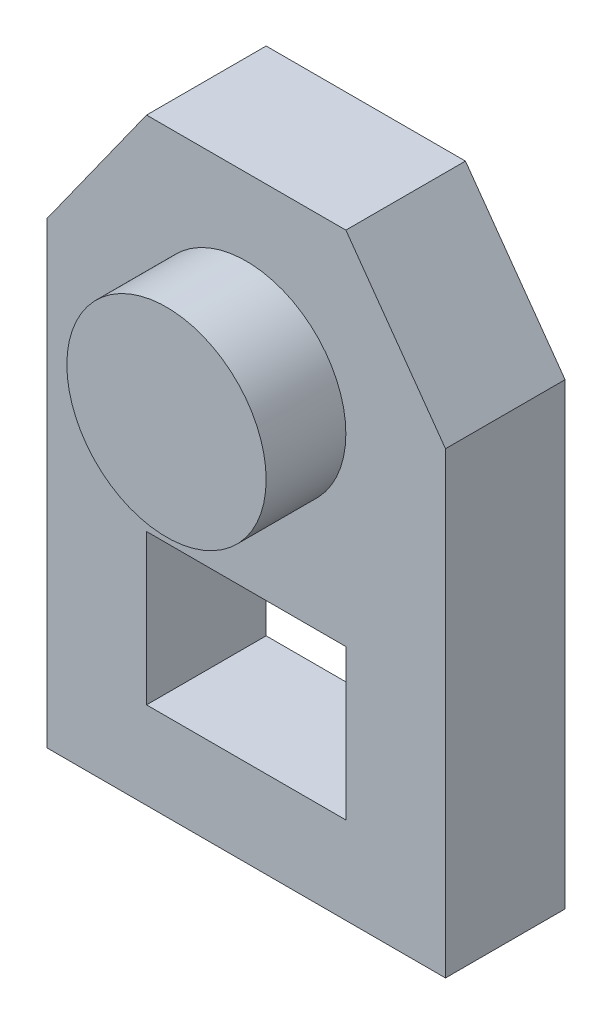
ISO-10303-21;
HEADER;
FILE_DESCRIPTION(('STEP AP214'),'2;1');
FILE_NAME('part.step','',(''),(''),'','','');
FILE_SCHEMA(('AUTOMOTIVE_DESIGN { 1 0 10303 214 1 1 1 1 }'));
ENDSEC;
DATA;
#1=APPLICATION_CONTEXT('core data for automotive mechanical design processes');
#2=APPLICATION_PROTOCOL_DEFINITION('international standard','automotive_design',2000,#1);
#3=PRODUCT_CONTEXT('',#1,'mechanical');
#4=PRODUCT('Part','Part','',(#3));
#5=PRODUCT_RELATED_PRODUCT_CATEGORY('part','',(#4));
#6=PRODUCT_DEFINITION_FORMATION('','',#4);
#7=PRODUCT_DEFINITION_CONTEXT('part definition',#1,'design');
#8=PRODUCT_DEFINITION('design','',#6,#7);
#9=PRODUCT_DEFINITION_SHAPE('','',#8);
#10=(LENGTH_UNIT() NAMED_UNIT(*) SI_UNIT(.MILLI.,.METRE.));
#11=(NAMED_UNIT(*) PLANE_ANGLE_UNIT() SI_UNIT($,.RADIAN.));
#12=(NAMED_UNIT(*) SI_UNIT($,.STERADIAN.) SOLID_ANGLE_UNIT());
#13=UNCERTAINTY_MEASURE_WITH_UNIT(LENGTH_MEASURE(1.E-05),#10,'distance_accuracy_value','');
#14=(GEOMETRIC_REPRESENTATION_CONTEXT(3) GLOBAL_UNCERTAINTY_ASSIGNED_CONTEXT((#13)) GLOBAL_UNIT_ASSIGNED_CONTEXT((#10,
#11,#12)) REPRESENTATION_CONTEXT('',''));
#15=CARTESIAN_POINT('',(0.,0.,0.));
#16=DIRECTION('',(0.,0.,1.));
#17=DIRECTION('',(1.,0.,0.));
#18=AXIS2_PLACEMENT_3D('',#15,#16,#17);
#19=CARTESIAN_POINT('',(0.,74.,12.));
#20=DIRECTION('',(0.,0.,1.));
#21=DIRECTION('',(1.,0.,0.));
#22=AXIS2_PLACEMENT_3D('',#19,#20,#21);
#23=PLANE('',#22);
#24=DIRECTION('',(0.,1.,0.));
#25=VECTOR('',#24,1.);
#26=CARTESIAN_POINT('',(10.,23.8052365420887,12.));
#27=LINE('',#26,#25);
#28=CARTESIAN_POINT('',(10.,8.73732717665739,12.));
#29=VERTEX_POINT('',#28);
#30=CARTESIAN_POINT('',(10.,23.8052365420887,12.));
#31=VERTEX_POINT('',#30);
#32=EDGE_CURVE('E46',#29,#31,#27,.T.);
#33=ORIENTED_EDGE('',*,*,#32,.F.);
#34=DIRECTION('',(1.,0.,0.));
#35=VECTOR('',#34,1.);
#36=CARTESIAN_POINT('',(10.,8.73732717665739,12.));
#37=LINE('',#36,#35);
#38=CARTESIAN_POINT('',(-10.,8.73732717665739,12.));
#39=VERTEX_POINT('',#38);
#40=EDGE_CURVE('E126',#39,#29,#37,.T.);
#41=ORIENTED_EDGE('',*,*,#40,.F.);
#42=DIRECTION('',(0.,-1.,0.));
#43=VECTOR('',#42,1.);
#44=CARTESIAN_POINT('',(-10.,23.8052365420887,12.));
#45=LINE('',#44,#43);
#46=CARTESIAN_POINT('',(-10.,23.8052365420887,12.));
#47=VERTEX_POINT('',#46);
#48=EDGE_CURVE('E111',#47,#39,#45,.T.);
#49=ORIENTED_EDGE('',*,*,#48,.F.);
#50=DIRECTION('',(-1.,0.,0.));
#51=VECTOR('',#50,1.);
#52=CARTESIAN_POINT('',(-10.,23.8052365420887,12.));
#53=LINE('',#52,#51);
#54=EDGE_CURVE('E120',#31,#47,#53,.T.);
#55=ORIENTED_EDGE('',*,*,#54,.F.);
#56=EDGE_LOOP('',(#33,#41,#49,#55));
#57=FACE_BOUND('',#56,.T.);
#58=DIRECTION('',(-0.581238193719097,-0.813733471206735,0.));
#59=VECTOR('',#58,1.);
#60=CARTESIAN_POINT('',(-10.,60.,12.));
#61=LINE('',#60,#59);
#62=CARTESIAN_POINT('',(-10.,60.,12.));
#63=VERTEX_POINT('',#62);
#64=CARTESIAN_POINT('',(-20.,46.,12.));
#65=VERTEX_POINT('',#64);
#66=EDGE_CURVE('E142',#63,#65,#61,.T.);
#67=ORIENTED_EDGE('',*,*,#66,.T.);
#68=DIRECTION('',(0.,-1.,0.));
#69=VECTOR('',#68,1.);
#70=CARTESIAN_POINT('',(-20.,46.,12.));
#71=LINE('',#70,#69);
#72=CARTESIAN_POINT('',(-20.,0.,12.));
#73=VERTEX_POINT('',#72);
#74=EDGE_CURVE('E145',#65,#73,#71,.T.);
#75=ORIENTED_EDGE('',*,*,#74,.T.);
#76=DIRECTION('',(1.,0.,0.));
#77=VECTOR('',#76,1.);
#78=CARTESIAN_POINT('',(-20.,0.,12.));
#79=LINE('',#78,#77);
#80=CARTESIAN_POINT('',(20.,0.,12.));
#81=VERTEX_POINT('',#80);
#82=EDGE_CURVE('E148',#73,#81,#79,.T.);
#83=ORIENTED_EDGE('',*,*,#82,.T.);
#84=DIRECTION('',(0.,1.,0.));
#85=VECTOR('',#84,1.);
#86=CARTESIAN_POINT('',(20.,46.,12.));
#87=LINE('',#86,#85);
#88=CARTESIAN_POINT('',(20.,46.,12.));
#89=VERTEX_POINT('',#88);
#90=EDGE_CURVE('E150',#81,#89,#87,.T.);
#91=ORIENTED_EDGE('',*,*,#90,.T.);
#92=DIRECTION('',(-0.581238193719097,0.813733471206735,0.));
#93=VECTOR('',#92,1.);
#94=CARTESIAN_POINT('',(10.,60.,12.));
#95=LINE('',#94,#93);
#96=CARTESIAN_POINT('',(10.,60.,12.));
#97=VERTEX_POINT('',#96);
#98=EDGE_CURVE('E152',#89,#97,#95,.T.);
#99=ORIENTED_EDGE('',*,*,#98,.T.);
#100=DIRECTION('',(-1.,0.,0.));
#101=VECTOR('',#100,1.);
#102=CARTESIAN_POINT('',(10.,60.,12.));
#103=LINE('',#102,#101);
#104=EDGE_CURVE('E154',#97,#63,#103,.T.);
#105=ORIENTED_EDGE('',*,*,#104,.T.);
#106=EDGE_LOOP('',(#67,#75,#83,#91,#99,#105));
#107=FACE_BOUND('',#106,.T.);
#108=CARTESIAN_POINT('',(0.,42.3114607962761,12.));
#109=DIRECTION('',(0.,0.,1.));
#110=DIRECTION('',(1.,0.,0.));
#111=AXIS2_PLACEMENT_3D('',#108,#109,#110);
#112=CIRCLE('',#111,10.);
#113=CARTESIAN_POINT('',(10.,42.3114607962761,12.));
#114=VERTEX_POINT('',#113);
#115=EDGE_CURVE('E133',#114,#114,#112,.T.);
#116=ORIENTED_EDGE('',*,*,#115,.F.);
#117=EDGE_LOOP('',(#116));
#118=FACE_BOUND('',#117,.T.);
#119=ADVANCED_FACE('F31',(#57,#107,#118),#23,.T.);
#120=CARTESIAN_POINT('',(-10.,60.,12.));
#121=DIRECTION('',(0.813733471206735,-0.581238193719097,0.));
#122=DIRECTION('',(0.581238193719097,0.813733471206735,0.));
#123=AXIS2_PLACEMENT_3D('',#120,#121,#122);
#124=PLANE('',#123);
#125=DIRECTION('',(-0.581238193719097,-0.813733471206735,0.));
#126=VECTOR('',#125,1.);
#127=CARTESIAN_POINT('',(-10.,60.,0.));
#128=LINE('',#127,#126);
#129=CARTESIAN_POINT('',(-10.,60.,0.));
#130=VERTEX_POINT('',#129);
#131=CARTESIAN_POINT('',(-20.,46.,0.));
#132=VERTEX_POINT('',#131);
#133=EDGE_CURVE('E139',#130,#132,#128,.T.);
#134=ORIENTED_EDGE('',*,*,#133,.T.);
#135=DIRECTION('',(0.,0.,-1.));
#136=VECTOR('',#135,1.);
#137=CARTESIAN_POINT('',(-20.,46.,12.));
#138=LINE('',#137,#136);
#139=EDGE_CURVE('E182',#65,#132,#138,.T.);
#140=ORIENTED_EDGE('',*,*,#139,.F.);
#141=ORIENTED_EDGE('',*,*,#66,.F.);
#142=DIRECTION('',(0.,0.,-1.));
#143=VECTOR('',#142,1.);
#144=CARTESIAN_POINT('',(-10.,60.,12.));
#145=LINE('',#144,#143);
#146=EDGE_CURVE('E156',#63,#130,#145,.T.);
#147=ORIENTED_EDGE('',*,*,#146,.T.);
#148=EDGE_LOOP('',(#134,#140,#141,#147));
#149=FACE_BOUND('',#148,.T.);
#150=ADVANCED_FACE('F33',(#149),#124,.F.);
#151=CARTESIAN_POINT('',(-20.,46.,12.));
#152=DIRECTION('',(1.,0.,0.));
#153=DIRECTION('',(0.,1.,0.));
#154=AXIS2_PLACEMENT_3D('',#151,#152,#153);
#155=PLANE('',#154);
#156=DIRECTION('',(0.,-1.,0.));
#157=VECTOR('',#156,1.);
#158=CARTESIAN_POINT('',(-20.,46.,0.));
#159=LINE('',#158,#157);
#160=CARTESIAN_POINT('',(-20.,0.,0.));
#161=VERTEX_POINT('',#160);
#162=EDGE_CURVE('E159',#132,#161,#159,.T.);
#163=ORIENTED_EDGE('',*,*,#162,.T.);
#164=DIRECTION('',(0.,0.,-1.));
#165=VECTOR('',#164,1.);
#166=CARTESIAN_POINT('',(-20.,0.,12.));
#167=LINE('',#166,#165);
#168=EDGE_CURVE('E179',#73,#161,#167,.T.);
#169=ORIENTED_EDGE('',*,*,#168,.F.);
#170=ORIENTED_EDGE('',*,*,#74,.F.);
#171=ORIENTED_EDGE('',*,*,#139,.T.);
#172=EDGE_LOOP('',(#163,#169,#170,#171));
#173=FACE_BOUND('',#172,.T.);
#174=ADVANCED_FACE('F212',(#173),#155,.F.);
#175=CARTESIAN_POINT('',(-20.,0.,12.));
#176=DIRECTION('',(0.,1.,0.));
#177=DIRECTION('',(0.,0.,1.));
#178=AXIS2_PLACEMENT_3D('',#175,#176,#177);
#179=PLANE('',#178);
#180=DIRECTION('',(1.,0.,0.));
#181=VECTOR('',#180,1.);
#182=CARTESIAN_POINT('',(-20.,0.,0.));
#183=LINE('',#182,#181);
#184=CARTESIAN_POINT('',(20.,0.,0.));
#185=VERTEX_POINT('',#184);
#186=EDGE_CURVE('E161',#161,#185,#183,.T.);
#187=ORIENTED_EDGE('',*,*,#186,.T.);
#188=DIRECTION('',(0.,0.,-1.));
#189=VECTOR('',#188,1.);
#190=CARTESIAN_POINT('',(20.,0.,12.));
#191=LINE('',#190,#189);
#192=EDGE_CURVE('E176',#81,#185,#191,.T.);
#193=ORIENTED_EDGE('',*,*,#192,.F.);
#194=ORIENTED_EDGE('',*,*,#82,.F.);
#195=ORIENTED_EDGE('',*,*,#168,.T.);
#196=EDGE_LOOP('',(#187,#193,#194,#195));
#197=FACE_BOUND('',#196,.T.);
#198=ADVANCED_FACE('F229',(#197),#179,.F.);
#199=CARTESIAN_POINT('',(20.,46.,12.));
#200=DIRECTION('',(-1.,0.,0.));
#201=DIRECTION('',(0.,-1.,0.));
#202=AXIS2_PLACEMENT_3D('',#199,#200,#201);
#203=PLANE('',#202);
#204=DIRECTION('',(0.,1.,0.));
#205=VECTOR('',#204,1.);
#206=CARTESIAN_POINT('',(20.,46.,0.));
#207=LINE('',#206,#205);
#208=CARTESIAN_POINT('',(20.,46.,0.));
#209=VERTEX_POINT('',#208);
#210=EDGE_CURVE('E163',#185,#209,#207,.T.);
#211=ORIENTED_EDGE('',*,*,#210,.T.);
#212=DIRECTION('',(0.,0.,-1.));
#213=VECTOR('',#212,1.);
#214=CARTESIAN_POINT('',(20.,46.,12.));
#215=LINE('',#214,#213);
#216=EDGE_CURVE('E173',#89,#209,#215,.T.);
#217=ORIENTED_EDGE('',*,*,#216,.F.);
#218=ORIENTED_EDGE('',*,*,#90,.F.);
#219=ORIENTED_EDGE('',*,*,#192,.T.);
#220=EDGE_LOOP('',(#211,#217,#218,#219));
#221=FACE_BOUND('',#220,.T.);
#222=ADVANCED_FACE('F225',(#221),#203,.F.);
#223=CARTESIAN_POINT('',(10.,60.,12.));
#224=DIRECTION('',(-0.813733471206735,-0.581238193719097,0.));
#225=DIRECTION('',(0.581238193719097,-0.813733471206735,0.));
#226=AXIS2_PLACEMENT_3D('',#223,#224,#225);
#227=PLANE('',#226);
#228=DIRECTION('',(-0.581238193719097,0.813733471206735,0.));
#229=VECTOR('',#228,1.);
#230=CARTESIAN_POINT('',(10.,60.,0.));
#231=LINE('',#230,#229);
#232=CARTESIAN_POINT('',(10.,60.,0.));
#233=VERTEX_POINT('',#232);
#234=EDGE_CURVE('E165',#209,#233,#231,.T.);
#235=ORIENTED_EDGE('',*,*,#234,.T.);
#236=DIRECTION('',(0.,0.,-1.));
#237=VECTOR('',#236,1.);
#238=CARTESIAN_POINT('',(10.,60.,12.));
#239=LINE('',#238,#237);
#240=EDGE_CURVE('E170',#97,#233,#239,.T.);
#241=ORIENTED_EDGE('',*,*,#240,.F.);
#242=ORIENTED_EDGE('',*,*,#98,.F.);
#243=ORIENTED_EDGE('',*,*,#216,.T.);
#244=EDGE_LOOP('',(#235,#241,#242,#243));
#245=FACE_BOUND('',#244,.T.);
#246=ADVANCED_FACE('F221',(#245),#227,.F.);
#247=CARTESIAN_POINT('',(10.,60.,12.));
#248=DIRECTION('',(0.,-1.,0.));
#249=DIRECTION('',(0.,0.,-1.));
#250=AXIS2_PLACEMENT_3D('',#247,#248,#249);
#251=PLANE('',#250);
#252=DIRECTION('',(-1.,0.,0.));
#253=VECTOR('',#252,1.);
#254=CARTESIAN_POINT('',(10.,60.,0.));
#255=LINE('',#254,#253);
#256=EDGE_CURVE('E146',#233,#130,#255,.T.);
#257=ORIENTED_EDGE('',*,*,#256,.T.);
#258=ORIENTED_EDGE('',*,*,#146,.F.);
#259=ORIENTED_EDGE('',*,*,#104,.F.);
#260=ORIENTED_EDGE('',*,*,#240,.T.);
#261=EDGE_LOOP('',(#257,#258,#259,#260));
#262=FACE_BOUND('',#261,.T.);
#263=ADVANCED_FACE('F218',(#262),#251,.F.);
#264=CARTESIAN_POINT('',(0.,74.,0.));
#265=DIRECTION('',(0.,0.,1.));
#266=DIRECTION('',(1.,0.,0.));
#267=AXIS2_PLACEMENT_3D('',#264,#265,#266);
#268=PLANE('',#267);
#269=DIRECTION('',(1.,0.,0.));
#270=VECTOR('',#269,1.);
#271=CARTESIAN_POINT('',(0.,8.73732717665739,0.));
#272=LINE('',#271,#270);
#273=CARTESIAN_POINT('',(-10.,8.73732717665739,0.));
#274=VERTEX_POINT('',#273);
#275=CARTESIAN_POINT('',(10.,8.73732717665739,0.));
#276=VERTEX_POINT('',#275);
#277=EDGE_CURVE('E39',#274,#276,#272,.T.);
#278=ORIENTED_EDGE('',*,*,#277,.T.);
#279=DIRECTION('',(0.,1.,0.));
#280=VECTOR('',#279,1.);
#281=CARTESIAN_POINT('',(10.,74.,0.));
#282=LINE('',#281,#280);
#283=CARTESIAN_POINT('',(10.,23.8052365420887,0.));
#284=VERTEX_POINT('',#283);
#285=EDGE_CURVE('E11',#276,#284,#282,.T.);
#286=ORIENTED_EDGE('',*,*,#285,.T.);
#287=DIRECTION('',(-1.,0.,0.));
#288=VECTOR('',#287,1.);
#289=CARTESIAN_POINT('',(0.,23.8052365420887,0.));
#290=LINE('',#289,#288);
#291=CARTESIAN_POINT('',(-10.,23.8052365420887,0.));
#292=VERTEX_POINT('',#291);
#293=EDGE_CURVE('E185',#284,#292,#290,.T.);
#294=ORIENTED_EDGE('',*,*,#293,.T.);
#295=DIRECTION('',(0.,-1.,0.));
#296=VECTOR('',#295,1.);
#297=CARTESIAN_POINT('',(-10.,74.,0.));
#298=LINE('',#297,#296);
#299=EDGE_CURVE('E114',#292,#274,#298,.T.);
#300=ORIENTED_EDGE('',*,*,#299,.T.);
#301=EDGE_LOOP('',(#278,#286,#294,#300));
#302=FACE_BOUND('',#301,.T.);
#303=ORIENTED_EDGE('',*,*,#133,.F.);
#304=ORIENTED_EDGE('',*,*,#256,.F.);
#305=ORIENTED_EDGE('',*,*,#234,.F.);
#306=ORIENTED_EDGE('',*,*,#210,.F.);
#307=ORIENTED_EDGE('',*,*,#186,.F.);
#308=ORIENTED_EDGE('',*,*,#162,.F.);
#309=EDGE_LOOP('',(#303,#304,#305,#306,#307,#308));
#310=FACE_BOUND('',#309,.T.);
#311=ADVANCED_FACE('F189',(#302,#310),#268,.F.);
#312=CARTESIAN_POINT('',(0.,42.3114607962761,20.));
#313=DIRECTION('',(0.,0.,-1.));
#314=DIRECTION('',(-1.,0.,0.));
#315=AXIS2_PLACEMENT_3D('',#312,#313,#314);
#316=CYLINDRICAL_SURFACE('',#315,10.);
#317=CARTESIAN_POINT('',(0.,42.3114607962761,20.));
#318=DIRECTION('',(0.,0.,1.));
#319=DIRECTION('',(1.,0.,0.));
#320=AXIS2_PLACEMENT_3D('',#317,#318,#319);
#321=CIRCLE('',#320,10.);
#322=CARTESIAN_POINT('',(10.,42.3114607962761,20.));
#323=VERTEX_POINT('',#322);
#324=EDGE_CURVE('E136',#323,#323,#321,.T.);
#325=ORIENTED_EDGE('',*,*,#324,.F.);
#326=EDGE_LOOP('',(#325));
#327=FACE_BOUND('',#326,.T.);
#328=ORIENTED_EDGE('',*,*,#115,.T.);
#329=EDGE_LOOP('',(#328));
#330=FACE_BOUND('',#329,.T.);
#331=ADVANCED_FACE('F203',(#327,#330),#316,.T.);
#332=CARTESIAN_POINT('',(0.,42.3114607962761,20.));
#333=DIRECTION('',(0.,0.,1.));
#334=DIRECTION('',(1.,0.,0.));
#335=AXIS2_PLACEMENT_3D('',#332,#333,#334);
#336=PLANE('',#335);
#337=ORIENTED_EDGE('',*,*,#324,.T.);
#338=EDGE_LOOP('',(#337));
#339=FACE_BOUND('',#338,.T.);
#340=ADVANCED_FACE('F196',(#339),#336,.T.);
#341=CARTESIAN_POINT('',(10.,23.8052365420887,-6.));
#342=DIRECTION('',(1.,0.,0.));
#343=DIRECTION('',(0.,0.,-1.));
#344=AXIS2_PLACEMENT_3D('',#341,#342,#343);
#345=PLANE('',#344);
#346=DIRECTION('',(0.,0.,1.));
#347=VECTOR('',#346,1.);
#348=CARTESIAN_POINT('',(10.,8.73732717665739,-6.));
#349=LINE('',#348,#347);
#350=EDGE_CURVE('E131',#276,#29,#349,.T.);
#351=ORIENTED_EDGE('',*,*,#350,.T.);
#352=ORIENTED_EDGE('',*,*,#32,.T.);
#353=DIRECTION('',(0.,0.,1.));
#354=VECTOR('',#353,1.);
#355=CARTESIAN_POINT('',(10.,23.8052365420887,-6.));
#356=LINE('',#355,#354);
#357=EDGE_CURVE('E117',#284,#31,#356,.T.);
#358=ORIENTED_EDGE('',*,*,#357,.F.);
#359=ORIENTED_EDGE('',*,*,#285,.F.);
#360=EDGE_LOOP('',(#351,#352,#358,#359));
#361=FACE_BOUND('',#360,.T.);
#362=ADVANCED_FACE('F194',(#361),#345,.F.);
#363=CARTESIAN_POINT('',(10.,8.73732717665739,-6.));
#364=DIRECTION('',(0.,-1.,0.));
#365=DIRECTION('',(0.,0.,-1.));
#366=AXIS2_PLACEMENT_3D('',#363,#364,#365);
#367=PLANE('',#366);
#368=DIRECTION('',(0.,0.,1.));
#369=VECTOR('',#368,1.);
#370=CARTESIAN_POINT('',(-10.,8.73732717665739,-6.));
#371=LINE('',#370,#369);
#372=EDGE_CURVE('E116',#274,#39,#371,.T.);
#373=ORIENTED_EDGE('',*,*,#372,.T.);
#374=ORIENTED_EDGE('',*,*,#40,.T.);
#375=ORIENTED_EDGE('',*,*,#350,.F.);
#376=ORIENTED_EDGE('',*,*,#277,.F.);
#377=EDGE_LOOP('',(#373,#374,#375,#376));
#378=FACE_BOUND('',#377,.T.);
#379=ADVANCED_FACE('F193',(#378),#367,.F.);
#380=CARTESIAN_POINT('',(-10.,23.8052365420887,-6.));
#381=DIRECTION('',(-1.,0.,0.));
#382=DIRECTION('',(0.,0.,1.));
#383=AXIS2_PLACEMENT_3D('',#380,#381,#382);
#384=PLANE('',#383);
#385=DIRECTION('',(0.,0.,1.));
#386=VECTOR('',#385,1.);
#387=CARTESIAN_POINT('',(-10.,23.8052365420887,-6.));
#388=LINE('',#387,#386);
#389=EDGE_CURVE('E54',#292,#47,#388,.T.);
#390=ORIENTED_EDGE('',*,*,#389,.T.);
#391=ORIENTED_EDGE('',*,*,#48,.T.);
#392=ORIENTED_EDGE('',*,*,#372,.F.);
#393=ORIENTED_EDGE('',*,*,#299,.F.);
#394=EDGE_LOOP('',(#390,#391,#392,#393));
#395=FACE_BOUND('',#394,.T.);
#396=ADVANCED_FACE('F108',(#395),#384,.F.);
#397=CARTESIAN_POINT('',(-10.,23.8052365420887,-6.));
#398=DIRECTION('',(0.,1.,0.));
#399=DIRECTION('',(0.,0.,1.));
#400=AXIS2_PLACEMENT_3D('',#397,#398,#399);
#401=PLANE('',#400);
#402=ORIENTED_EDGE('',*,*,#357,.T.);
#403=ORIENTED_EDGE('',*,*,#54,.T.);
#404=ORIENTED_EDGE('',*,*,#389,.F.);
#405=ORIENTED_EDGE('',*,*,#293,.F.);
#406=EDGE_LOOP('',(#402,#403,#404,#405));
#407=FACE_BOUND('',#406,.T.);
#408=ADVANCED_FACE('F121',(#407),#401,.F.);
#409=CLOSED_SHELL('',(#119,#150,#174,#198,#222,#246,#263,#311,#331,#340,#362,#379,#396,#408));
#410=MANIFOLD_SOLID_BREP('B2',#409);
#411=ADVANCED_BREP_SHAPE_REPRESENTATION('',(#18,#410),#14);
#412=SHAPE_DEFINITION_REPRESENTATION(#9,#411);
ENDSEC;
END-ISO-10303-21;
